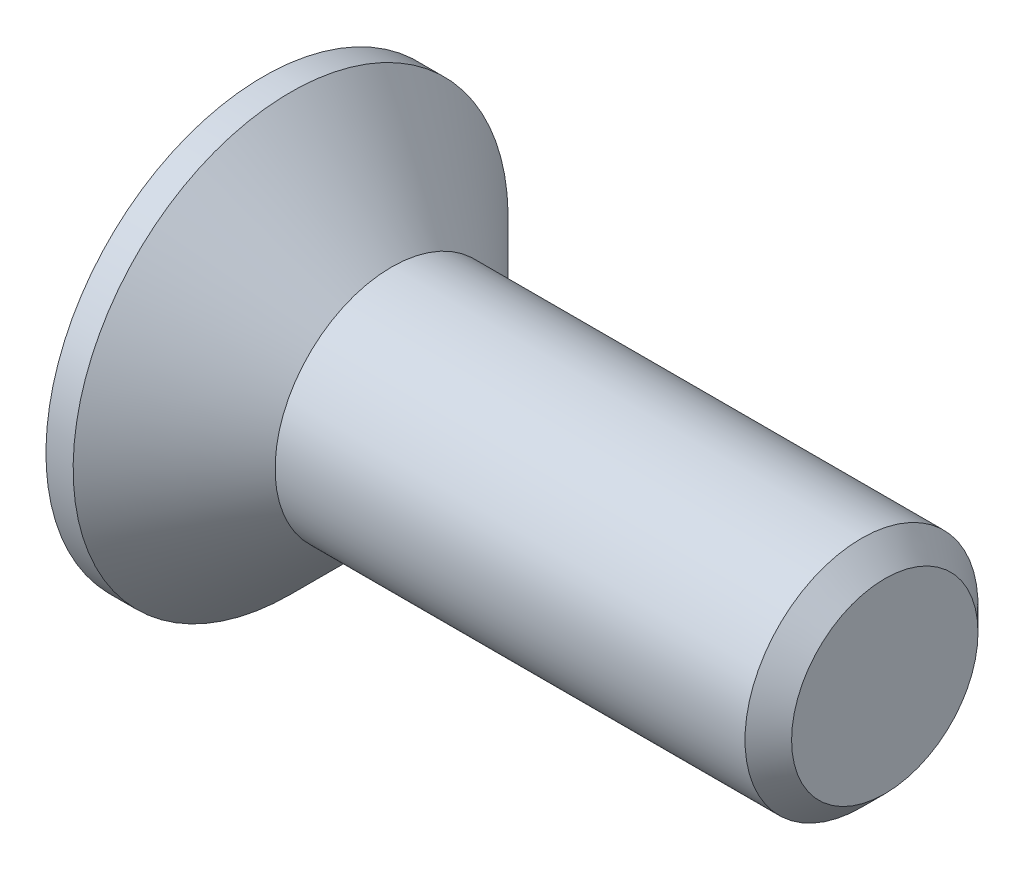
ISO-10303-21;
HEADER;
FILE_DESCRIPTION(('STEP AP214'),'2;1');
FILE_NAME('part.step','',(''),(''),'','','');
FILE_SCHEMA(('AUTOMOTIVE_DESIGN { 1 0 10303 214 1 1 1 1 }'));
ENDSEC;
DATA;
#1=APPLICATION_CONTEXT('core data for automotive mechanical design processes');
#2=APPLICATION_PROTOCOL_DEFINITION('international standard','automotive_design',2000,#1);
#3=PRODUCT_CONTEXT('',#1,'mechanical');
#4=PRODUCT('Part','Part','',(#3));
#5=PRODUCT_RELATED_PRODUCT_CATEGORY('part','',(#4));
#6=PRODUCT_DEFINITION_FORMATION('','',#4);
#7=PRODUCT_DEFINITION_CONTEXT('part definition',#1,'design');
#8=PRODUCT_DEFINITION('design','',#6,#7);
#9=PRODUCT_DEFINITION_SHAPE('','',#8);
#10=(LENGTH_UNIT() NAMED_UNIT(*) SI_UNIT(.MILLI.,.METRE.));
#11=(NAMED_UNIT(*) PLANE_ANGLE_UNIT() SI_UNIT($,.RADIAN.));
#12=(NAMED_UNIT(*) SI_UNIT($,.STERADIAN.) SOLID_ANGLE_UNIT());
#13=UNCERTAINTY_MEASURE_WITH_UNIT(LENGTH_MEASURE(1.E-05),#10,'distance_accuracy_value','');
#14=(GEOMETRIC_REPRESENTATION_CONTEXT(3) GLOBAL_UNCERTAINTY_ASSIGNED_CONTEXT((#13)) GLOBAL_UNIT_ASSIGNED_CONTEXT((#10,
#11,#12)) REPRESENTATION_CONTEXT('',''));
#15=CARTESIAN_POINT('',(0.,0.,0.));
#16=DIRECTION('',(0.,0.,1.));
#17=DIRECTION('',(1.,0.,0.));
#18=AXIS2_PLACEMENT_3D('',#15,#16,#17);
#19=CARTESIAN_POINT('',(0.,0.,0.));
#20=DIRECTION('',(-1.,0.,0.));
#21=DIRECTION('',(0.,-1.,0.));
#22=AXIS2_PLACEMENT_3D('',#19,#20,#21);
#23=CONICAL_SURFACE('',#22,1.5,0.78539816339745);
#24=CARTESIAN_POINT('',(-1.3,0.,0.));
#25=DIRECTION('',(-1.,0.,0.));
#26=DIRECTION('',(0.,-1.,0.));
#27=AXIS2_PLACEMENT_3D('',#24,#25,#26);
#28=CIRCLE('',#27,2.8);
#29=CARTESIAN_POINT('',(-1.3,-2.8,0.));
#30=VERTEX_POINT('',#29);
#31=EDGE_CURVE('E189',#30,#30,#28,.T.);
#32=ORIENTED_EDGE('',*,*,#31,.F.);
#33=EDGE_LOOP('',(#32));
#34=FACE_BOUND('',#33,.T.);
#35=CARTESIAN_POINT('',(0.,0.,0.));
#36=DIRECTION('',(-1.,0.,0.));
#37=DIRECTION('',(0.,-1.,0.));
#38=AXIS2_PLACEMENT_3D('',#35,#36,#37);
#39=CIRCLE('',#38,1.5);
#40=CARTESIAN_POINT('',(0.,-1.5,0.));
#41=VERTEX_POINT('',#40);
#42=EDGE_CURVE('E212',#41,#41,#39,.T.);
#43=ORIENTED_EDGE('',*,*,#42,.T.);
#44=EDGE_LOOP('',(#43));
#45=FACE_BOUND('',#44,.T.);
#46=ADVANCED_FACE('F33',(#34,#45),#23,.T.);
#47=CARTESIAN_POINT('',(-1.65,0.,0.));
#48=DIRECTION('',(-1.,0.,0.));
#49=DIRECTION('',(0.,-1.,0.));
#50=AXIS2_PLACEMENT_3D('',#47,#48,#49);
#51=CYLINDRICAL_SURFACE('',#50,1.5);
#52=CARTESIAN_POINT('',(6.05,0.,0.));
#53=DIRECTION('',(-1.,0.,0.));
#54=DIRECTION('',(0.,-1.,0.));
#55=AXIS2_PLACEMENT_3D('',#52,#53,#54);
#56=CIRCLE('',#55,1.5);
#57=CARTESIAN_POINT('',(6.05,-1.5,0.));
#58=VERTEX_POINT('',#57);
#59=EDGE_CURVE('E41',#58,#58,#56,.T.);
#60=ORIENTED_EDGE('',*,*,#59,.T.);
#61=EDGE_LOOP('',(#60));
#62=FACE_BOUND('',#61,.T.);
#63=ORIENTED_EDGE('',*,*,#42,.F.);
#64=EDGE_LOOP('',(#63));
#65=FACE_BOUND('',#64,.T.);
#66=ADVANCED_FACE('F217',(#62,#65),#51,.T.);
#67=CARTESIAN_POINT('',(6.35,0.,0.));
#68=DIRECTION('',(-1.,0.,0.));
#69=DIRECTION('',(0.,-1.,0.));
#70=AXIS2_PLACEMENT_3D('',#67,#68,#69);
#71=PLANE('',#70);
#72=CARTESIAN_POINT('',(6.35,0.,0.));
#73=DIRECTION('',(-1.,0.,0.));
#74=DIRECTION('',(0.,-1.,0.));
#75=AXIS2_PLACEMENT_3D('',#72,#73,#74);
#76=CIRCLE('',#75,1.2);
#77=CARTESIAN_POINT('',(6.35,-1.2,0.));
#78=VERTEX_POINT('',#77);
#79=EDGE_CURVE('E11',#78,#78,#76,.F.);
#80=ORIENTED_EDGE('',*,*,#79,.T.);
#81=EDGE_LOOP('',(#80));
#82=FACE_BOUND('',#81,.T.);
#83=ADVANCED_FACE('F239',(#82),#71,.F.);
#84=CARTESIAN_POINT('',(-1.65,2.8,0.));
#85=DIRECTION('',(1.,0.,0.));
#86=DIRECTION('',(0.,1.,0.));
#87=AXIS2_PLACEMENT_3D('',#84,#85,#86);
#88=PLANE('',#87);
#89=DIRECTION('',(0.,0.,-1.));
#90=VECTOR('',#89,1.);
#91=CARTESIAN_POINT('',(-1.65,0.365,-1.45));
#92=LINE('',#91,#90);
#93=CARTESIAN_POINT('',(-1.65,0.365,-0.365));
#94=VERTEX_POINT('',#93);
#95=CARTESIAN_POINT('',(-1.65,0.365,-1.45));
#96=VERTEX_POINT('',#95);
#97=EDGE_CURVE('E158',#94,#96,#92,.T.);
#98=ORIENTED_EDGE('',*,*,#97,.F.);
#99=DIRECTION('',(0.,-1.,0.));
#100=VECTOR('',#99,1.);
#101=CARTESIAN_POINT('',(-1.65,0.365,-0.365));
#102=LINE('',#101,#100);
#103=CARTESIAN_POINT('',(-1.65,1.45,-0.365));
#104=VERTEX_POINT('',#103);
#105=EDGE_CURVE('E48',#104,#94,#102,.T.);
#106=ORIENTED_EDGE('',*,*,#105,.F.);
#107=DIRECTION('',(0.,0.,-1.));
#108=VECTOR('',#107,1.);
#109=CARTESIAN_POINT('',(-1.65,1.45,-0.365));
#110=LINE('',#109,#108);
#111=CARTESIAN_POINT('',(-1.65,1.45,0.365));
#112=VERTEX_POINT('',#111);
#113=EDGE_CURVE('E185',#112,#104,#110,.T.);
#114=ORIENTED_EDGE('',*,*,#113,.F.);
#115=DIRECTION('',(0.,1.,0.));
#116=VECTOR('',#115,1.);
#117=CARTESIAN_POINT('',(-1.65,1.45,0.365));
#118=LINE('',#117,#116);
#119=CARTESIAN_POINT('',(-1.65,0.365,0.365));
#120=VERTEX_POINT('',#119);
#121=EDGE_CURVE('E183',#120,#112,#118,.T.);
#122=ORIENTED_EDGE('',*,*,#121,.F.);
#123=DIRECTION('',(0.,0.,-1.));
#124=VECTOR('',#123,1.);
#125=CARTESIAN_POINT('',(-1.65,0.365,0.365));
#126=LINE('',#125,#124);
#127=CARTESIAN_POINT('',(-1.65,0.365,1.45));
#128=VERTEX_POINT('',#127);
#129=EDGE_CURVE('E132',#128,#120,#126,.T.);
#130=ORIENTED_EDGE('',*,*,#129,.F.);
#131=DIRECTION('',(0.,1.,0.));
#132=VECTOR('',#131,1.);
#133=CARTESIAN_POINT('',(-1.65,0.365,1.45));
#134=LINE('',#133,#132);
#135=CARTESIAN_POINT('',(-1.65,-0.365,1.45));
#136=VERTEX_POINT('',#135);
#137=EDGE_CURVE('E179',#136,#128,#134,.T.);
#138=ORIENTED_EDGE('',*,*,#137,.F.);
#139=DIRECTION('',(0.,0.,1.));
#140=VECTOR('',#139,1.);
#141=CARTESIAN_POINT('',(-1.65,-0.365,1.45));
#142=LINE('',#141,#140);
#143=CARTESIAN_POINT('',(-1.65,-0.365,0.365));
#144=VERTEX_POINT('',#143);
#145=EDGE_CURVE('E176',#144,#136,#142,.T.);
#146=ORIENTED_EDGE('',*,*,#145,.F.);
#147=DIRECTION('',(0.,1.,0.));
#148=VECTOR('',#147,1.);
#149=CARTESIAN_POINT('',(-1.65,-0.365,0.365));
#150=LINE('',#149,#148);
#151=CARTESIAN_POINT('',(-1.65,-1.45,0.365));
#152=VERTEX_POINT('',#151);
#153=EDGE_CURVE('E173',#152,#144,#150,.T.);
#154=ORIENTED_EDGE('',*,*,#153,.F.);
#155=DIRECTION('',(0.,0.,1.));
#156=VECTOR('',#155,1.);
#157=CARTESIAN_POINT('',(-1.65,-1.45,0.365));
#158=LINE('',#157,#156);
#159=CARTESIAN_POINT('',(-1.65,-1.45,-0.365));
#160=VERTEX_POINT('',#159);
#161=EDGE_CURVE('E170',#160,#152,#158,.T.);
#162=ORIENTED_EDGE('',*,*,#161,.F.);
#163=DIRECTION('',(0.,-1.,0.));
#164=VECTOR('',#163,1.);
#165=CARTESIAN_POINT('',(-1.65,-1.45,-0.365));
#166=LINE('',#165,#164);
#167=CARTESIAN_POINT('',(-1.65,-0.365,-0.365));
#168=VERTEX_POINT('',#167);
#169=EDGE_CURVE('E167',#168,#160,#166,.T.);
#170=ORIENTED_EDGE('',*,*,#169,.F.);
#171=DIRECTION('',(0.,0.,1.));
#172=VECTOR('',#171,1.);
#173=CARTESIAN_POINT('',(-1.65,-0.365,-0.365));
#174=LINE('',#173,#172);
#175=CARTESIAN_POINT('',(-1.65,-0.365,-1.45));
#176=VERTEX_POINT('',#175);
#177=EDGE_CURVE('E164',#176,#168,#174,.T.);
#178=ORIENTED_EDGE('',*,*,#177,.F.);
#179=DIRECTION('',(0.,-1.,0.));
#180=VECTOR('',#179,1.);
#181=CARTESIAN_POINT('',(-1.65,-0.365,-1.45));
#182=LINE('',#181,#180);
#183=EDGE_CURVE('E161',#96,#176,#182,.T.);
#184=ORIENTED_EDGE('',*,*,#183,.F.);
#185=EDGE_LOOP('',(#98,#106,#114,#122,#130,#138,#146,#154,#162,#170,#178,#184));
#186=FACE_BOUND('',#185,.T.);
#187=CARTESIAN_POINT('',(-1.65,0.,0.));
#188=DIRECTION('',(-1.,0.,0.));
#189=DIRECTION('',(0.,-1.,0.));
#190=AXIS2_PLACEMENT_3D('',#187,#188,#189);
#191=CIRCLE('',#190,2.8);
#192=CARTESIAN_POINT('',(-1.65,-2.8,0.));
#193=VERTEX_POINT('',#192);
#194=EDGE_CURVE('E209',#193,#193,#191,.T.);
#195=ORIENTED_EDGE('',*,*,#194,.T.);
#196=EDGE_LOOP('',(#195));
#197=FACE_BOUND('',#196,.T.);
#198=ADVANCED_FACE('F230',(#186,#197),#88,.F.);
#199=CARTESIAN_POINT('',(-1.65,0.,0.));
#200=DIRECTION('',(-1.,0.,0.));
#201=DIRECTION('',(0.,-1.,0.));
#202=AXIS2_PLACEMENT_3D('',#199,#200,#201);
#203=CYLINDRICAL_SURFACE('',#202,2.8);
#204=ORIENTED_EDGE('',*,*,#194,.F.);
#205=EDGE_LOOP('',(#204));
#206=FACE_BOUND('',#205,.T.);
#207=ORIENTED_EDGE('',*,*,#31,.T.);
#208=EDGE_LOOP('',(#207));
#209=FACE_BOUND('',#208,.T.);
#210=ADVANCED_FACE('F222',(#206,#209),#203,.T.);
#211=CARTESIAN_POINT('',(6.05,0.,0.));
#212=DIRECTION('',(-1.,0.,0.));
#213=DIRECTION('',(0.,-1.,0.));
#214=AXIS2_PLACEMENT_3D('',#211,#212,#213);
#215=CONICAL_SURFACE('',#214,1.5,0.785398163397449);
#216=ORIENTED_EDGE('',*,*,#79,.F.);
#217=EDGE_LOOP('',(#216));
#218=FACE_BOUND('',#217,.T.);
#219=ORIENTED_EDGE('',*,*,#59,.F.);
#220=EDGE_LOOP('',(#219));
#221=FACE_BOUND('',#220,.T.);
#222=ADVANCED_FACE('F35',(#218,#221),#215,.T.);
#223=CARTESIAN_POINT('',(-0.4,0.365,-0.365));
#224=DIRECTION('',(0.,0.,-1.));
#225=DIRECTION('',(-1.,0.,0.));
#226=AXIS2_PLACEMENT_3D('',#223,#224,#225);
#227=PLANE('',#226);
#228=ORIENTED_EDGE('',*,*,#105,.T.);
#229=DIRECTION('',(-1.,0.,0.));
#230=VECTOR('',#229,1.);
#231=CARTESIAN_POINT('',(-0.4,0.365,-0.365));
#232=LINE('',#231,#230);
#233=CARTESIAN_POINT('',(-0.4,0.365,-0.365));
#234=VERTEX_POINT('',#233);
#235=EDGE_CURVE('E96',#234,#94,#232,.T.);
#236=ORIENTED_EDGE('',*,*,#235,.F.);
#237=DIRECTION('',(0.,-1.,0.));
#238=VECTOR('',#237,1.);
#239=CARTESIAN_POINT('',(-0.4,0.365,-0.365));
#240=LINE('',#239,#238);
#241=CARTESIAN_POINT('',(-0.4,1.45,-0.365));
#242=VERTEX_POINT('',#241);
#243=EDGE_CURVE('E187',#242,#234,#240,.T.);
#244=ORIENTED_EDGE('',*,*,#243,.F.);
#245=DIRECTION('',(-1.,0.,0.));
#246=VECTOR('',#245,1.);
#247=CARTESIAN_POINT('',(-0.4,1.45,-0.365));
#248=LINE('',#247,#246);
#249=EDGE_CURVE('E56',#242,#104,#248,.T.);
#250=ORIENTED_EDGE('',*,*,#249,.T.);
#251=EDGE_LOOP('',(#228,#236,#244,#250));
#252=FACE_BOUND('',#251,.T.);
#253=ADVANCED_FACE('F221',(#252),#227,.F.);
#254=CARTESIAN_POINT('',(-0.4,1.45,-0.365));
#255=DIRECTION('',(0.,1.,0.));
#256=DIRECTION('',(-1.,0.,0.));
#257=AXIS2_PLACEMENT_3D('',#254,#255,#256);
#258=PLANE('',#257);
#259=ORIENTED_EDGE('',*,*,#113,.T.);
#260=ORIENTED_EDGE('',*,*,#249,.F.);
#261=DIRECTION('',(0.,0.,-1.));
#262=VECTOR('',#261,1.);
#263=CARTESIAN_POINT('',(-0.4,1.45,-0.365));
#264=LINE('',#263,#262);
#265=CARTESIAN_POINT('',(-0.4,1.45,0.365));
#266=VERTEX_POINT('',#265);
#267=EDGE_CURVE('E144',#266,#242,#264,.T.);
#268=ORIENTED_EDGE('',*,*,#267,.F.);
#269=DIRECTION('',(-1.,0.,0.));
#270=VECTOR('',#269,1.);
#271=CARTESIAN_POINT('',(-0.4,1.45,0.365));
#272=LINE('',#271,#270);
#273=EDGE_CURVE('E136',#266,#112,#272,.T.);
#274=ORIENTED_EDGE('',*,*,#273,.T.);
#275=EDGE_LOOP('',(#259,#260,#268,#274));
#276=FACE_BOUND('',#275,.T.);
#277=ADVANCED_FACE('F228',(#276),#258,.F.);
#278=CARTESIAN_POINT('',(-0.4,1.45,0.365));
#279=DIRECTION('',(0.,0.,1.));
#280=DIRECTION('',(1.,0.,0.));
#281=AXIS2_PLACEMENT_3D('',#278,#279,#280);
#282=PLANE('',#281);
#283=ORIENTED_EDGE('',*,*,#121,.T.);
#284=ORIENTED_EDGE('',*,*,#273,.F.);
#285=DIRECTION('',(0.,1.,0.));
#286=VECTOR('',#285,1.);
#287=CARTESIAN_POINT('',(-0.4,1.45,0.365));
#288=LINE('',#287,#286);
#289=CARTESIAN_POINT('',(-0.4,0.365,0.365));
#290=VERTEX_POINT('',#289);
#291=EDGE_CURVE('E140',#290,#266,#288,.T.);
#292=ORIENTED_EDGE('',*,*,#291,.F.);
#293=DIRECTION('',(-1.,0.,0.));
#294=VECTOR('',#293,1.);
#295=CARTESIAN_POINT('',(-0.4,0.365,0.365));
#296=LINE('',#295,#294);
#297=EDGE_CURVE('E125',#290,#120,#296,.T.);
#298=ORIENTED_EDGE('',*,*,#297,.T.);
#299=EDGE_LOOP('',(#283,#284,#292,#298));
#300=FACE_BOUND('',#299,.T.);
#301=ADVANCED_FACE('F141',(#300),#282,.F.);
#302=CARTESIAN_POINT('',(-0.4,0.365,0.365));
#303=DIRECTION('',(0.,1.,0.));
#304=DIRECTION('',(-1.,0.,0.));
#305=AXIS2_PLACEMENT_3D('',#302,#303,#304);
#306=PLANE('',#305);
#307=ORIENTED_EDGE('',*,*,#129,.T.);
#308=ORIENTED_EDGE('',*,*,#297,.F.);
#309=DIRECTION('',(0.,0.,-1.));
#310=VECTOR('',#309,1.);
#311=CARTESIAN_POINT('',(-0.4,0.365,0.365));
#312=LINE('',#311,#310);
#313=CARTESIAN_POINT('',(-0.4,0.365,1.45));
#314=VERTEX_POINT('',#313);
#315=EDGE_CURVE('E129',#314,#290,#312,.T.);
#316=ORIENTED_EDGE('',*,*,#315,.F.);
#317=DIRECTION('',(-1.,0.,0.));
#318=VECTOR('',#317,1.);
#319=CARTESIAN_POINT('',(-0.4,0.365,1.45));
#320=LINE('',#319,#318);
#321=EDGE_CURVE('E137',#314,#128,#320,.T.);
#322=ORIENTED_EDGE('',*,*,#321,.T.);
#323=EDGE_LOOP('',(#307,#308,#316,#322));
#324=FACE_BOUND('',#323,.T.);
#325=ADVANCED_FACE('F127',(#324),#306,.F.);
#326=CARTESIAN_POINT('',(-0.4,0.365,1.45));
#327=DIRECTION('',(0.,0.,1.));
#328=DIRECTION('',(1.,0.,0.));
#329=AXIS2_PLACEMENT_3D('',#326,#327,#328);
#330=PLANE('',#329);
#331=ORIENTED_EDGE('',*,*,#137,.T.);
#332=ORIENTED_EDGE('',*,*,#321,.F.);
#333=DIRECTION('',(0.,1.,0.));
#334=VECTOR('',#333,1.);
#335=CARTESIAN_POINT('',(-0.4,0.365,1.45));
#336=LINE('',#335,#334);
#337=CARTESIAN_POINT('',(-0.4,-0.365,1.45));
#338=VERTEX_POINT('',#337);
#339=EDGE_CURVE('E150',#338,#314,#336,.T.);
#340=ORIENTED_EDGE('',*,*,#339,.F.);
#341=DIRECTION('',(-1.,0.,0.));
#342=VECTOR('',#341,1.);
#343=CARTESIAN_POINT('',(-0.4,-0.365,1.45));
#344=LINE('',#343,#342);
#345=EDGE_CURVE('E192',#338,#136,#344,.T.);
#346=ORIENTED_EDGE('',*,*,#345,.T.);
#347=EDGE_LOOP('',(#331,#332,#340,#346));
#348=FACE_BOUND('',#347,.T.);
#349=ADVANCED_FACE('F277',(#348),#330,.F.);
#350=CARTESIAN_POINT('',(-0.4,-0.365,1.45));
#351=DIRECTION('',(0.,-1.,0.));
#352=DIRECTION('',(1.,0.,0.));
#353=AXIS2_PLACEMENT_3D('',#350,#351,#352);
#354=PLANE('',#353);
#355=ORIENTED_EDGE('',*,*,#145,.T.);
#356=ORIENTED_EDGE('',*,*,#345,.F.);
#357=DIRECTION('',(0.,0.,1.));
#358=VECTOR('',#357,1.);
#359=CARTESIAN_POINT('',(-0.4,-0.365,1.45));
#360=LINE('',#359,#358);
#361=CARTESIAN_POINT('',(-0.4,-0.365,0.365));
#362=VERTEX_POINT('',#361);
#363=EDGE_CURVE('E152',#362,#338,#360,.T.);
#364=ORIENTED_EDGE('',*,*,#363,.F.);
#365=DIRECTION('',(-1.,0.,0.));
#366=VECTOR('',#365,1.);
#367=CARTESIAN_POINT('',(-0.4,-0.365,0.365));
#368=LINE('',#367,#366);
#369=EDGE_CURVE('E194',#362,#144,#368,.T.);
#370=ORIENTED_EDGE('',*,*,#369,.T.);
#371=EDGE_LOOP('',(#355,#356,#364,#370));
#372=FACE_BOUND('',#371,.T.);
#373=ADVANCED_FACE('F273',(#372),#354,.F.);
#374=CARTESIAN_POINT('',(-0.4,-0.365,0.365));
#375=DIRECTION('',(0.,0.,1.));
#376=DIRECTION('',(1.,0.,0.));
#377=AXIS2_PLACEMENT_3D('',#374,#375,#376);
#378=PLANE('',#377);
#379=ORIENTED_EDGE('',*,*,#153,.T.);
#380=ORIENTED_EDGE('',*,*,#369,.F.);
#381=DIRECTION('',(0.,1.,0.));
#382=VECTOR('',#381,1.);
#383=CARTESIAN_POINT('',(-0.4,-0.365,0.365));
#384=LINE('',#383,#382);
#385=CARTESIAN_POINT('',(-0.4,-1.45,0.365));
#386=VERTEX_POINT('',#385);
#387=EDGE_CURVE('E422',#386,#362,#384,.T.);
#388=ORIENTED_EDGE('',*,*,#387,.F.);
#389=DIRECTION('',(-1.,0.,0.));
#390=VECTOR('',#389,1.);
#391=CARTESIAN_POINT('',(-0.4,-1.45,0.365));
#392=LINE('',#391,#390);
#393=EDGE_CURVE('E196',#386,#152,#392,.T.);
#394=ORIENTED_EDGE('',*,*,#393,.T.);
#395=EDGE_LOOP('',(#379,#380,#388,#394));
#396=FACE_BOUND('',#395,.T.);
#397=ADVANCED_FACE('F269',(#396),#378,.F.);
#398=CARTESIAN_POINT('',(-0.4,-1.45,0.365));
#399=DIRECTION('',(0.,-1.,0.));
#400=DIRECTION('',(1.,0.,0.));
#401=AXIS2_PLACEMENT_3D('',#398,#399,#400);
#402=PLANE('',#401);
#403=ORIENTED_EDGE('',*,*,#161,.T.);
#404=ORIENTED_EDGE('',*,*,#393,.F.);
#405=DIRECTION('',(0.,0.,1.));
#406=VECTOR('',#405,1.);
#407=CARTESIAN_POINT('',(-0.4,-1.45,0.365));
#408=LINE('',#407,#406);
#409=CARTESIAN_POINT('',(-0.4,-1.45,-0.365));
#410=VERTEX_POINT('',#409);
#411=EDGE_CURVE('E419',#410,#386,#408,.T.);
#412=ORIENTED_EDGE('',*,*,#411,.F.);
#413=DIRECTION('',(-1.,0.,0.));
#414=VECTOR('',#413,1.);
#415=CARTESIAN_POINT('',(-0.4,-1.45,-0.365));
#416=LINE('',#415,#414);
#417=EDGE_CURVE('E198',#410,#160,#416,.T.);
#418=ORIENTED_EDGE('',*,*,#417,.T.);
#419=EDGE_LOOP('',(#403,#404,#412,#418));
#420=FACE_BOUND('',#419,.T.);
#421=ADVANCED_FACE('F265',(#420),#402,.F.);
#422=CARTESIAN_POINT('',(-0.4,-1.45,-0.365));
#423=DIRECTION('',(0.,0.,-1.));
#424=DIRECTION('',(-1.,0.,0.));
#425=AXIS2_PLACEMENT_3D('',#422,#423,#424);
#426=PLANE('',#425);
#427=ORIENTED_EDGE('',*,*,#169,.T.);
#428=ORIENTED_EDGE('',*,*,#417,.F.);
#429=DIRECTION('',(0.,-1.,0.));
#430=VECTOR('',#429,1.);
#431=CARTESIAN_POINT('',(-0.4,-1.45,-0.365));
#432=LINE('',#431,#430);
#433=CARTESIAN_POINT('',(-0.4,-0.365,-0.365));
#434=VERTEX_POINT('',#433);
#435=EDGE_CURVE('E416',#434,#410,#432,.T.);
#436=ORIENTED_EDGE('',*,*,#435,.F.);
#437=DIRECTION('',(-1.,0.,0.));
#438=VECTOR('',#437,1.);
#439=CARTESIAN_POINT('',(-0.4,-0.365,-0.365));
#440=LINE('',#439,#438);
#441=EDGE_CURVE('E200',#434,#168,#440,.T.);
#442=ORIENTED_EDGE('',*,*,#441,.T.);
#443=EDGE_LOOP('',(#427,#428,#436,#442));
#444=FACE_BOUND('',#443,.T.);
#445=ADVANCED_FACE('F261',(#444),#426,.F.);
#446=CARTESIAN_POINT('',(-0.4,-0.365,-0.365));
#447=DIRECTION('',(0.,-1.,0.));
#448=DIRECTION('',(1.,0.,0.));
#449=AXIS2_PLACEMENT_3D('',#446,#447,#448);
#450=PLANE('',#449);
#451=ORIENTED_EDGE('',*,*,#177,.T.);
#452=ORIENTED_EDGE('',*,*,#441,.F.);
#453=DIRECTION('',(0.,0.,1.));
#454=VECTOR('',#453,1.);
#455=CARTESIAN_POINT('',(-0.4,-0.365,-0.365));
#456=LINE('',#455,#454);
#457=CARTESIAN_POINT('',(-0.4,-0.365,-1.45));
#458=VERTEX_POINT('',#457);
#459=EDGE_CURVE('E413',#458,#434,#456,.T.);
#460=ORIENTED_EDGE('',*,*,#459,.F.);
#461=DIRECTION('',(-1.,0.,0.));
#462=VECTOR('',#461,1.);
#463=CARTESIAN_POINT('',(-0.4,-0.365,-1.45));
#464=LINE('',#463,#462);
#465=EDGE_CURVE('E202',#458,#176,#464,.T.);
#466=ORIENTED_EDGE('',*,*,#465,.T.);
#467=EDGE_LOOP('',(#451,#452,#460,#466));
#468=FACE_BOUND('',#467,.T.);
#469=ADVANCED_FACE('F257',(#468),#450,.F.);
#470=CARTESIAN_POINT('',(-0.4,-0.365,-1.45));
#471=DIRECTION('',(0.,0.,-1.));
#472=DIRECTION('',(-1.,0.,0.));
#473=AXIS2_PLACEMENT_3D('',#470,#471,#472);
#474=PLANE('',#473);
#475=ORIENTED_EDGE('',*,*,#183,.T.);
#476=ORIENTED_EDGE('',*,*,#465,.F.);
#477=DIRECTION('',(0.,-1.,0.));
#478=VECTOR('',#477,1.);
#479=CARTESIAN_POINT('',(-0.4,-0.365,-1.45));
#480=LINE('',#479,#478);
#481=CARTESIAN_POINT('',(-0.4,0.365,-1.45));
#482=VERTEX_POINT('',#481);
#483=EDGE_CURVE('E408',#482,#458,#480,.T.);
#484=ORIENTED_EDGE('',*,*,#483,.F.);
#485=DIRECTION('',(-1.,0.,0.));
#486=VECTOR('',#485,1.);
#487=CARTESIAN_POINT('',(-0.4,0.365,-1.45));
#488=LINE('',#487,#486);
#489=EDGE_CURVE('E204',#482,#96,#488,.T.);
#490=ORIENTED_EDGE('',*,*,#489,.T.);
#491=EDGE_LOOP('',(#475,#476,#484,#490));
#492=FACE_BOUND('',#491,.T.);
#493=ADVANCED_FACE('F253',(#492),#474,.F.);
#494=CARTESIAN_POINT('',(-0.4,0.365,-1.45));
#495=DIRECTION('',(0.,1.,0.));
#496=DIRECTION('',(-1.,0.,0.));
#497=AXIS2_PLACEMENT_3D('',#494,#495,#496);
#498=PLANE('',#497);
#499=ORIENTED_EDGE('',*,*,#97,.T.);
#500=ORIENTED_EDGE('',*,*,#489,.F.);
#501=DIRECTION('',(0.,0.,-1.));
#502=VECTOR('',#501,1.);
#503=CARTESIAN_POINT('',(-0.4,0.365,-1.45));
#504=LINE('',#503,#502);
#505=EDGE_CURVE('E406',#234,#482,#504,.T.);
#506=ORIENTED_EDGE('',*,*,#505,.F.);
#507=ORIENTED_EDGE('',*,*,#235,.T.);
#508=EDGE_LOOP('',(#499,#500,#506,#507));
#509=FACE_BOUND('',#508,.T.);
#510=ADVANCED_FACE('F250',(#509),#498,.F.);
#511=CARTESIAN_POINT('',(-0.4,0.,0.));
#512=DIRECTION('',(1.,0.,0.));
#513=DIRECTION('',(0.,0.,-1.));
#514=AXIS2_PLACEMENT_3D('',#511,#512,#513);
#515=PLANE('',#514);
#516=ORIENTED_EDGE('',*,*,#243,.T.);
#517=ORIENTED_EDGE('',*,*,#505,.T.);
#518=ORIENTED_EDGE('',*,*,#483,.T.);
#519=ORIENTED_EDGE('',*,*,#459,.T.);
#520=ORIENTED_EDGE('',*,*,#435,.T.);
#521=ORIENTED_EDGE('',*,*,#411,.T.);
#522=ORIENTED_EDGE('',*,*,#387,.T.);
#523=ORIENTED_EDGE('',*,*,#363,.T.);
#524=ORIENTED_EDGE('',*,*,#339,.T.);
#525=ORIENTED_EDGE('',*,*,#315,.T.);
#526=ORIENTED_EDGE('',*,*,#291,.T.);
#527=ORIENTED_EDGE('',*,*,#267,.T.);
#528=EDGE_LOOP('',(#516,#517,#518,#519,#520,#521,#522,#523,#524,#525,#526,#527));
#529=FACE_BOUND('',#528,.T.);
#530=ADVANCED_FACE('F147',(#529),#515,.F.);
#531=CLOSED_SHELL('',(#46,#66,#83,#198,#210,#222,#253,#277,#301,#325,#349,#373,#397,#421,#445,
#469,#493,#510,#530));
#532=MANIFOLD_SOLID_BREP('B2',#531);
#533=ADVANCED_BREP_SHAPE_REPRESENTATION('',(#18,#532),#14);
#534=SHAPE_DEFINITION_REPRESENTATION(#9,#533);
ENDSEC;
END-ISO-10303-21;
